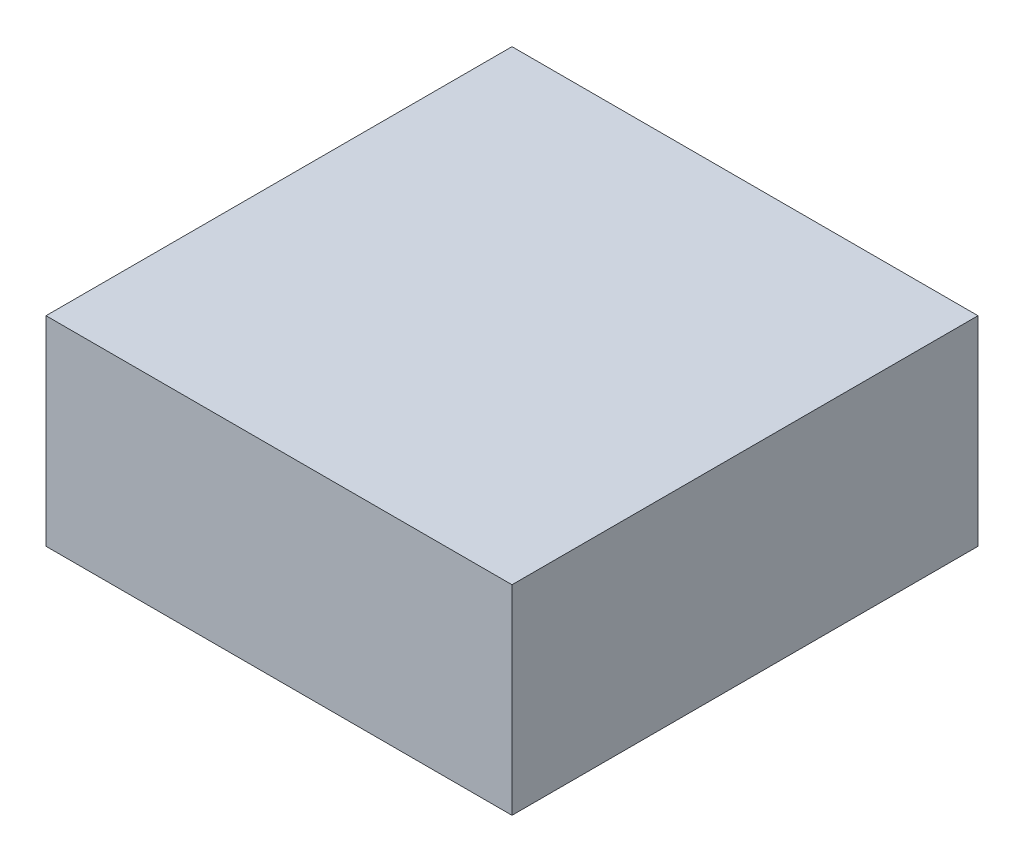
from build123d import *

# Parameters (mm, degrees)
SKETCH1_W           = 88.9
SKETCH1_H           = 88.9
BOSS_EXTRUDE1_DEPTH = 38.1


with BuildPart() as part:
    # Sketch1 → Boss-Extrude1 (new body)
    with BuildSketch(Plane(origin=(0, 0, 0), x_dir=(1, 0, 0), z_dir=(0, 1, 0))):
        with Locations((44.45, 44.45)):
            Rectangle(SKETCH1_W, SKETCH1_H)
    extrude(amount=BOSS_EXTRUDE1_DEPTH)


solid = part.part
